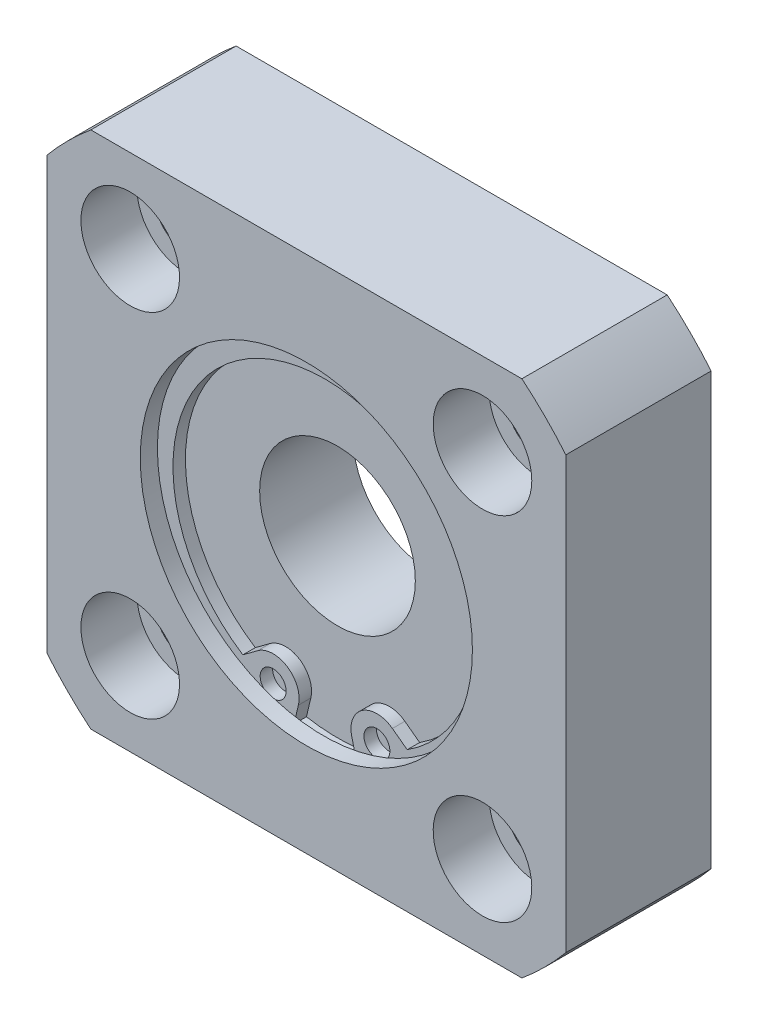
ISO-10303-21;
HEADER;
FILE_DESCRIPTION(('STEP AP214'),'2;1');
FILE_NAME('part.step','',(''),(''),'','','');
FILE_SCHEMA(('AUTOMOTIVE_DESIGN { 1 0 10303 214 1 1 1 1 }'));
ENDSEC;
DATA;
#1=APPLICATION_CONTEXT('core data for automotive mechanical design processes');
#2=APPLICATION_PROTOCOL_DEFINITION('international standard','automotive_design',2000,#1);
#3=PRODUCT_CONTEXT('',#1,'mechanical');
#4=PRODUCT('Part','Part','',(#3));
#5=PRODUCT_RELATED_PRODUCT_CATEGORY('part','',(#4));
#6=PRODUCT_DEFINITION_FORMATION('','',#4);
#7=PRODUCT_DEFINITION_CONTEXT('part definition',#1,'design');
#8=PRODUCT_DEFINITION('design','',#6,#7);
#9=PRODUCT_DEFINITION_SHAPE('','',#8);
#10=(LENGTH_UNIT() NAMED_UNIT(*) SI_UNIT(.MILLI.,.METRE.));
#11=(NAMED_UNIT(*) PLANE_ANGLE_UNIT() SI_UNIT($,.RADIAN.));
#12=(NAMED_UNIT(*) SI_UNIT($,.STERADIAN.) SOLID_ANGLE_UNIT());
#13=UNCERTAINTY_MEASURE_WITH_UNIT(LENGTH_MEASURE(1.E-05),#10,'distance_accuracy_value','');
#14=(GEOMETRIC_REPRESENTATION_CONTEXT(3) GLOBAL_UNCERTAINTY_ASSIGNED_CONTEXT((#13)) GLOBAL_UNIT_ASSIGNED_CONTEXT((#10,
#11,#12)) REPRESENTATION_CONTEXT('',''));
#15=CARTESIAN_POINT('',(0.,0.,0.));
#16=DIRECTION('',(0.,0.,1.));
#17=DIRECTION('',(1.,0.,0.));
#18=AXIS2_PLACEMENT_3D('',#15,#16,#17);
#19=CARTESIAN_POINT('',(0.,0.,11.));
#20=DIRECTION('',(0.,0.,1.));
#21=DIRECTION('',(1.,0.,0.));
#22=AXIS2_PLACEMENT_3D('',#19,#20,#21);
#23=PLANE('',#22);
#24=CARTESIAN_POINT('',(5.,-14.2233767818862,11.));
#25=DIRECTION('',(0.,0.,1.));
#26=DIRECTION('',(1.,0.,0.));
#27=AXIS2_PLACEMENT_3D('',#24,#25,#26);
#28=CIRCLE('',#27,1.25);
#29=CARTESIAN_POINT('',(6.25,-14.2233767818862,11.));
#30=VERTEX_POINT('',#29);
#31=EDGE_CURVE('E169',#30,#30,#28,.T.);
#32=ORIENTED_EDGE('',*,*,#31,.T.);
#33=EDGE_LOOP('',(#32));
#34=FACE_BOUND('',#33,.T.);
#35=ADVANCED_FACE('F14',(#34),#23,.T.);
#36=CARTESIAN_POINT('',(-5.,-14.2233767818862,11.));
#37=DIRECTION('',(0.,0.,-1.));
#38=DIRECTION('',(1.,0.,0.));
#39=AXIS2_PLACEMENT_3D('',#36,#37,#38);
#40=CIRCLE('',#39,1.25);
#41=CARTESIAN_POINT('',(-3.75,-14.2233767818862,11.));
#42=VERTEX_POINT('',#41);
#43=EDGE_CURVE('E179',#42,#42,#40,.T.);
#44=ORIENTED_EDGE('',*,*,#43,.F.);
#45=EDGE_LOOP('',(#44));
#46=FACE_BOUND('',#45,.T.);
#47=ADVANCED_FACE('F377',(#46),#23,.T.);
#48=CARTESIAN_POINT('',(16.9705627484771,16.9705627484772,8.6));
#49=DIRECTION('',(0.,0.,1.));
#50=DIRECTION('',(1.,0.,0.));
#51=AXIS2_PLACEMENT_3D('',#48,#49,#50);
#52=PLANE('',#51);
#53=CARTESIAN_POINT('',(16.9705627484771,16.9705627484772,8.6));
#54=DIRECTION('',(0.,0.,1.));
#55=DIRECTION('',(1.,0.,0.));
#56=AXIS2_PLACEMENT_3D('',#53,#54,#55);
#57=CIRCLE('',#56,4.75);
#58=CARTESIAN_POINT('',(21.7205627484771,16.9705627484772,8.6));
#59=VERTEX_POINT('',#58);
#60=EDGE_CURVE('E274',#59,#59,#57,.T.);
#61=ORIENTED_EDGE('',*,*,#60,.T.);
#62=EDGE_LOOP('',(#61));
#63=FACE_BOUND('',#62,.T.);
#64=CARTESIAN_POINT('',(16.9705627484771,16.9705627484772,8.6));
#65=DIRECTION('',(0.,0.,1.));
#66=DIRECTION('',(1.,0.,0.));
#67=AXIS2_PLACEMENT_3D('',#64,#65,#66);
#68=CIRCLE('',#67,3.);
#69=CARTESIAN_POINT('',(19.970562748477,16.9705627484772,8.6));
#70=VERTEX_POINT('',#69);
#71=EDGE_CURVE('E277',#70,#70,#68,.F.);
#72=ORIENTED_EDGE('',*,*,#71,.T.);
#73=EDGE_LOOP('',(#72));
#74=FACE_BOUND('',#73,.T.);
#75=ADVANCED_FACE('F385',(#63,#74),#52,.T.);
#76=CARTESIAN_POINT('',(16.9705627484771,-16.9705627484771,8.6));
#77=DIRECTION('',(0.,0.,1.));
#78=DIRECTION('',(0.,-1.,0.));
#79=AXIS2_PLACEMENT_3D('',#76,#77,#78);
#80=PLANE('',#79);
#81=CARTESIAN_POINT('',(16.9705627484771,-16.9705627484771,8.6));
#82=DIRECTION('',(0.,0.,1.));
#83=DIRECTION('',(0.,-1.,0.));
#84=AXIS2_PLACEMENT_3D('',#81,#82,#83);
#85=CIRCLE('',#84,4.75);
#86=CARTESIAN_POINT('',(16.9705627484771,-21.7205627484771,8.6));
#87=VERTEX_POINT('',#86);
#88=EDGE_CURVE('E258',#87,#87,#85,.T.);
#89=ORIENTED_EDGE('',*,*,#88,.T.);
#90=EDGE_LOOP('',(#89));
#91=FACE_BOUND('',#90,.T.);
#92=CARTESIAN_POINT('',(16.9705627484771,-16.9705627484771,8.6));
#93=DIRECTION('',(0.,0.,1.));
#94=DIRECTION('',(1.,0.,0.));
#95=AXIS2_PLACEMENT_3D('',#92,#93,#94);
#96=CIRCLE('',#95,3.);
#97=CARTESIAN_POINT('',(19.9705627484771,-16.9705627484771,8.6));
#98=VERTEX_POINT('',#97);
#99=EDGE_CURVE('E261',#98,#98,#96,.F.);
#100=ORIENTED_EDGE('',*,*,#99,.T.);
#101=EDGE_LOOP('',(#100));
#102=FACE_BOUND('',#101,.T.);
#103=ADVANCED_FACE('F754',(#91,#102),#80,.T.);
#104=CARTESIAN_POINT('',(-16.9705627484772,-16.9705627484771,8.6));
#105=DIRECTION('',(0.,0.,1.));
#106=DIRECTION('',(-1.,0.,0.));
#107=AXIS2_PLACEMENT_3D('',#104,#105,#106);
#108=PLANE('',#107);
#109=CARTESIAN_POINT('',(-16.9705627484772,-16.9705627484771,8.6));
#110=DIRECTION('',(0.,0.,1.));
#111=DIRECTION('',(-1.,0.,0.));
#112=AXIS2_PLACEMENT_3D('',#109,#110,#111);
#113=CIRCLE('',#112,4.75);
#114=CARTESIAN_POINT('',(-21.7205627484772,-16.9705627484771,8.6));
#115=VERTEX_POINT('',#114);
#116=EDGE_CURVE('E251',#115,#115,#113,.T.);
#117=ORIENTED_EDGE('',*,*,#116,.T.);
#118=EDGE_LOOP('',(#117));
#119=FACE_BOUND('',#118,.T.);
#120=CARTESIAN_POINT('',(-16.9705627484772,-16.9705627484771,8.6));
#121=DIRECTION('',(0.,0.,1.));
#122=DIRECTION('',(1.,0.,0.));
#123=AXIS2_PLACEMENT_3D('',#120,#121,#122);
#124=CIRCLE('',#123,3.);
#125=CARTESIAN_POINT('',(-13.9705627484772,-16.9705627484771,8.6));
#126=VERTEX_POINT('',#125);
#127=EDGE_CURVE('E254',#126,#126,#124,.F.);
#128=ORIENTED_EDGE('',*,*,#127,.T.);
#129=EDGE_LOOP('',(#128));
#130=FACE_BOUND('',#129,.T.);
#131=ADVANCED_FACE('F744',(#119,#130),#108,.T.);
#132=CARTESIAN_POINT('',(-16.9705627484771,16.9705627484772,8.6));
#133=DIRECTION('',(0.,0.,1.));
#134=DIRECTION('',(0.,1.,0.));
#135=AXIS2_PLACEMENT_3D('',#132,#133,#134);
#136=PLANE('',#135);
#137=CARTESIAN_POINT('',(-16.9705627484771,16.9705627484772,8.6));
#138=DIRECTION('',(0.,0.,1.));
#139=DIRECTION('',(0.,1.,0.));
#140=AXIS2_PLACEMENT_3D('',#137,#138,#139);
#141=CIRCLE('',#140,4.75);
#142=CARTESIAN_POINT('',(-16.970562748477,21.7205627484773,8.6));
#143=VERTEX_POINT('',#142);
#144=EDGE_CURVE('E244',#143,#143,#141,.T.);
#145=ORIENTED_EDGE('',*,*,#144,.T.);
#146=EDGE_LOOP('',(#145));
#147=FACE_BOUND('',#146,.T.);
#148=CARTESIAN_POINT('',(-16.9705627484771,16.9705627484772,8.6));
#149=DIRECTION('',(0.,0.,1.));
#150=DIRECTION('',(1.,0.,0.));
#151=AXIS2_PLACEMENT_3D('',#148,#149,#150);
#152=CIRCLE('',#151,3.);
#153=CARTESIAN_POINT('',(-13.9705627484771,16.9705627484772,8.6));
#154=VERTEX_POINT('',#153);
#155=EDGE_CURVE('E247',#154,#154,#152,.F.);
#156=ORIENTED_EDGE('',*,*,#155,.T.);
#157=EDGE_LOOP('',(#156));
#158=FACE_BOUND('',#157,.T.);
#159=ADVANCED_FACE('F734',(#147,#158),#136,.T.);
#160=CARTESIAN_POINT('',(16.9705627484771,16.9705627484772,0.));
#161=DIRECTION('',(0.,0.,1.));
#162=DIRECTION('',(1.,0.,0.));
#163=AXIS2_PLACEMENT_3D('',#160,#161,#162);
#164=CYLINDRICAL_SURFACE('',#163,3.);
#165=CARTESIAN_POINT('',(16.9705627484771,16.9705627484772,0.));
#166=DIRECTION('',(0.,0.,1.));
#167=DIRECTION('',(1.,0.,0.));
#168=AXIS2_PLACEMENT_3D('',#165,#166,#167);
#169=CIRCLE('',#168,3.);
#170=CARTESIAN_POINT('',(19.970562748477,16.9705627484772,0.));
#171=VERTEX_POINT('',#170);
#172=EDGE_CURVE('E278',#171,#171,#169,.T.);
#173=ORIENTED_EDGE('',*,*,#172,.F.);
#174=EDGE_LOOP('',(#173));
#175=FACE_BOUND('',#174,.T.);
#176=ORIENTED_EDGE('',*,*,#71,.F.);
#177=EDGE_LOOP('',(#176));
#178=FACE_BOUND('',#177,.T.);
#179=ADVANCED_FACE('F724',(#175,#178),#164,.F.);
#180=CARTESIAN_POINT('',(16.9705627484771,-16.9705627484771,0.));
#181=DIRECTION('',(0.,0.,1.));
#182=DIRECTION('',(1.,0.,0.));
#183=AXIS2_PLACEMENT_3D('',#180,#181,#182);
#184=CYLINDRICAL_SURFACE('',#183,3.);
#185=CARTESIAN_POINT('',(16.9705627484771,-16.9705627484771,0.));
#186=DIRECTION('',(0.,0.,1.));
#187=DIRECTION('',(0.,-1.,0.));
#188=AXIS2_PLACEMENT_3D('',#185,#186,#187);
#189=CIRCLE('',#188,3.);
#190=CARTESIAN_POINT('',(16.9705627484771,-19.9705627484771,0.));
#191=VERTEX_POINT('',#190);
#192=EDGE_CURVE('E268',#191,#191,#189,.T.);
#193=ORIENTED_EDGE('',*,*,#192,.F.);
#194=EDGE_LOOP('',(#193));
#195=FACE_BOUND('',#194,.T.);
#196=ORIENTED_EDGE('',*,*,#99,.F.);
#197=EDGE_LOOP('',(#196));
#198=FACE_BOUND('',#197,.T.);
#199=ADVANCED_FACE('F714',(#195,#198),#184,.F.);
#200=CARTESIAN_POINT('',(-16.9705627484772,-16.9705627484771,0.));
#201=DIRECTION('',(0.,0.,1.));
#202=DIRECTION('',(1.,0.,0.));
#203=AXIS2_PLACEMENT_3D('',#200,#201,#202);
#204=CYLINDRICAL_SURFACE('',#203,3.);
#205=CARTESIAN_POINT('',(-16.9705627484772,-16.9705627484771,0.));
#206=DIRECTION('',(0.,0.,1.));
#207=DIRECTION('',(-1.,0.,0.));
#208=AXIS2_PLACEMENT_3D('',#205,#206,#207);
#209=CIRCLE('',#208,3.);
#210=CARTESIAN_POINT('',(-19.9705627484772,-16.9705627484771,0.));
#211=VERTEX_POINT('',#210);
#212=EDGE_CURVE('E265',#211,#211,#209,.T.);
#213=ORIENTED_EDGE('',*,*,#212,.F.);
#214=EDGE_LOOP('',(#213));
#215=FACE_BOUND('',#214,.T.);
#216=ORIENTED_EDGE('',*,*,#127,.F.);
#217=EDGE_LOOP('',(#216));
#218=FACE_BOUND('',#217,.T.);
#219=ADVANCED_FACE('F704',(#215,#218),#204,.F.);
#220=CARTESIAN_POINT('',(-16.9705627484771,16.9705627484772,0.));
#221=DIRECTION('',(0.,0.,1.));
#222=DIRECTION('',(1.,0.,0.));
#223=AXIS2_PLACEMENT_3D('',#220,#221,#222);
#224=CYLINDRICAL_SURFACE('',#223,3.);
#225=CARTESIAN_POINT('',(-16.9705627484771,16.9705627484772,0.));
#226=DIRECTION('',(0.,0.,1.));
#227=DIRECTION('',(0.,1.,0.));
#228=AXIS2_PLACEMENT_3D('',#225,#226,#227);
#229=CIRCLE('',#228,3.);
#230=CARTESIAN_POINT('',(-16.970562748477,19.9705627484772,0.));
#231=VERTEX_POINT('',#230);
#232=EDGE_CURVE('E262',#231,#231,#229,.T.);
#233=ORIENTED_EDGE('',*,*,#232,.F.);
#234=EDGE_LOOP('',(#233));
#235=FACE_BOUND('',#234,.T.);
#236=ORIENTED_EDGE('',*,*,#155,.F.);
#237=EDGE_LOOP('',(#236));
#238=FACE_BOUND('',#237,.T.);
#239=ADVANCED_FACE('F694',(#235,#238),#224,.F.);
#240=CARTESIAN_POINT('',(-20.7665596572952,-25.,14.));
#241=DIRECTION('',(0.,1.,0.));
#242=DIRECTION('',(0.,0.,1.));
#243=AXIS2_PLACEMENT_3D('',#240,#241,#242);
#244=PLANE('',#243);
#245=DIRECTION('',(1.,0.,0.));
#246=VECTOR('',#245,1.);
#247=CARTESIAN_POINT('',(-20.7665596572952,-25.,14.));
#248=LINE('',#247,#246);
#249=CARTESIAN_POINT('',(-20.7665596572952,-25.,14.));
#250=VERTEX_POINT('',#249);
#251=CARTESIAN_POINT('',(20.7665596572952,-25.,14.));
#252=VERTEX_POINT('',#251);
#253=EDGE_CURVE('E306',#250,#252,#248,.T.);
#254=ORIENTED_EDGE('',*,*,#253,.F.);
#255=DIRECTION('',(0.,0.,-1.));
#256=VECTOR('',#255,1.);
#257=CARTESIAN_POINT('',(-20.7665596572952,-25.,14.));
#258=LINE('',#257,#256);
#259=CARTESIAN_POINT('',(-20.7665596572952,-25.,0.));
#260=VERTEX_POINT('',#259);
#261=EDGE_CURVE('E329',#250,#260,#258,.T.);
#262=ORIENTED_EDGE('',*,*,#261,.T.);
#263=DIRECTION('',(1.,0.,0.));
#264=VECTOR('',#263,1.);
#265=CARTESIAN_POINT('',(-20.7665596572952,-25.,0.));
#266=LINE('',#265,#264);
#267=CARTESIAN_POINT('',(20.7665596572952,-25.,0.));
#268=VERTEX_POINT('',#267);
#269=EDGE_CURVE('E284',#260,#268,#266,.T.);
#270=ORIENTED_EDGE('',*,*,#269,.T.);
#271=DIRECTION('',(0.,0.,-1.));
#272=VECTOR('',#271,1.);
#273=CARTESIAN_POINT('',(20.7665596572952,-25.,14.));
#274=LINE('',#273,#272);
#275=EDGE_CURVE('E327',#252,#268,#274,.T.);
#276=ORIENTED_EDGE('',*,*,#275,.F.);
#277=EDGE_LOOP('',(#254,#262,#270,#276));
#278=FACE_BOUND('',#277,.T.);
#279=ADVANCED_FACE('F684',(#278),#244,.F.);
#280=CARTESIAN_POINT('',(0.,0.,14.));
#281=DIRECTION('',(0.,0.,-1.));
#282=DIRECTION('',(-1.,0.,0.));
#283=AXIS2_PLACEMENT_3D('',#280,#281,#282);
#284=CYLINDRICAL_SURFACE('',#283,32.5);
#285=ORIENTED_EDGE('',*,*,#261,.F.);
#286=CARTESIAN_POINT('',(0.,0.,14.));
#287=DIRECTION('',(0.,0.,1.));
#288=DIRECTION('',(1.,0.,0.));
#289=AXIS2_PLACEMENT_3D('',#286,#287,#288);
#290=CIRCLE('',#289,32.5);
#291=CARTESIAN_POINT('',(-25.,-20.7665596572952,14.));
#292=VERTEX_POINT('',#291);
#293=EDGE_CURVE('E309',#292,#250,#290,.T.);
#294=ORIENTED_EDGE('',*,*,#293,.F.);
#295=DIRECTION('',(0.,0.,-1.));
#296=VECTOR('',#295,1.);
#297=CARTESIAN_POINT('',(-25.,-20.7665596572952,14.));
#298=LINE('',#297,#296);
#299=CARTESIAN_POINT('',(-25.,-20.7665596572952,0.));
#300=VERTEX_POINT('',#299);
#301=EDGE_CURVE('E331',#292,#300,#298,.T.);
#302=ORIENTED_EDGE('',*,*,#301,.T.);
#303=CARTESIAN_POINT('',(0.,0.,0.));
#304=DIRECTION('',(0.,0.,1.));
#305=DIRECTION('',(1.,0.,0.));
#306=AXIS2_PLACEMENT_3D('',#303,#304,#305);
#307=CIRCLE('',#306,32.5);
#308=EDGE_CURVE('E287',#300,#260,#307,.T.);
#309=ORIENTED_EDGE('',*,*,#308,.T.);
#310=EDGE_LOOP('',(#285,#294,#302,#309));
#311=FACE_BOUND('',#310,.T.);
#312=ADVANCED_FACE('F674',(#311),#284,.T.);
#313=CARTESIAN_POINT('',(-25.,-20.7665596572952,14.));
#314=DIRECTION('',(-1.,0.,0.));
#315=DIRECTION('',(0.,0.,1.));
#316=AXIS2_PLACEMENT_3D('',#313,#314,#315);
#317=PLANE('',#316);
#318=ORIENTED_EDGE('',*,*,#301,.F.);
#319=DIRECTION('',(0.,1.,0.));
#320=VECTOR('',#319,1.);
#321=CARTESIAN_POINT('',(-25.,-20.7665596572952,14.));
#322=LINE('',#321,#320);
#323=CARTESIAN_POINT('',(-25.,20.7665596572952,14.));
#324=VERTEX_POINT('',#323);
#325=EDGE_CURVE('E312',#292,#324,#322,.T.);
#326=ORIENTED_EDGE('',*,*,#325,.T.);
#327=DIRECTION('',(0.,0.,-1.));
#328=VECTOR('',#327,1.);
#329=CARTESIAN_POINT('',(-25.,20.7665596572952,14.));
#330=LINE('',#329,#328);
#331=CARTESIAN_POINT('',(-25.,20.7665596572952,0.));
#332=VERTEX_POINT('',#331);
#333=EDGE_CURVE('E333',#324,#332,#330,.T.);
#334=ORIENTED_EDGE('',*,*,#333,.T.);
#335=DIRECTION('',(0.,1.,0.));
#336=VECTOR('',#335,1.);
#337=CARTESIAN_POINT('',(-25.,-20.7665596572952,0.));
#338=LINE('',#337,#336);
#339=EDGE_CURVE('E290',#300,#332,#338,.T.);
#340=ORIENTED_EDGE('',*,*,#339,.F.);
#341=EDGE_LOOP('',(#318,#326,#334,#340));
#342=FACE_BOUND('',#341,.T.);
#343=ADVANCED_FACE('F664',(#342),#317,.T.);
#344=CARTESIAN_POINT('',(0.,0.,14.));
#345=DIRECTION('',(0.,0.,-1.));
#346=DIRECTION('',(-1.,0.,0.));
#347=AXIS2_PLACEMENT_3D('',#344,#345,#346);
#348=CYLINDRICAL_SURFACE('',#347,32.5);
#349=ORIENTED_EDGE('',*,*,#333,.F.);
#350=CARTESIAN_POINT('',(0.,0.,14.));
#351=DIRECTION('',(0.,0.,-1.));
#352=DIRECTION('',(-1.,0.,0.));
#353=AXIS2_PLACEMENT_3D('',#350,#351,#352);
#354=CIRCLE('',#353,32.5);
#355=CARTESIAN_POINT('',(-20.7665596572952,25.,14.));
#356=VERTEX_POINT('',#355);
#357=EDGE_CURVE('E315',#324,#356,#354,.T.);
#358=ORIENTED_EDGE('',*,*,#357,.T.);
#359=DIRECTION('',(0.,0.,-1.));
#360=VECTOR('',#359,1.);
#361=CARTESIAN_POINT('',(-20.7665596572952,25.,14.));
#362=LINE('',#361,#360);
#363=CARTESIAN_POINT('',(-20.7665596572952,25.,0.));
#364=VERTEX_POINT('',#363);
#365=EDGE_CURVE('E335',#356,#364,#362,.T.);
#366=ORIENTED_EDGE('',*,*,#365,.T.);
#367=CARTESIAN_POINT('',(0.,0.,0.));
#368=DIRECTION('',(0.,0.,-1.));
#369=DIRECTION('',(-1.,0.,0.));
#370=AXIS2_PLACEMENT_3D('',#367,#368,#369);
#371=CIRCLE('',#370,32.5);
#372=EDGE_CURVE('E293',#332,#364,#371,.T.);
#373=ORIENTED_EDGE('',*,*,#372,.F.);
#374=EDGE_LOOP('',(#349,#358,#366,#373));
#375=FACE_BOUND('',#374,.T.);
#376=ADVANCED_FACE('F654',(#375),#348,.T.);
#377=CARTESIAN_POINT('',(-20.7665596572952,25.,14.));
#378=DIRECTION('',(0.,1.,0.));
#379=DIRECTION('',(0.,0.,1.));
#380=AXIS2_PLACEMENT_3D('',#377,#378,#379);
#381=PLANE('',#380);
#382=ORIENTED_EDGE('',*,*,#365,.F.);
#383=DIRECTION('',(1.,0.,0.));
#384=VECTOR('',#383,1.);
#385=CARTESIAN_POINT('',(-20.7665596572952,25.,14.));
#386=LINE('',#385,#384);
#387=CARTESIAN_POINT('',(20.7665596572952,25.,14.));
#388=VERTEX_POINT('',#387);
#389=EDGE_CURVE('E318',#356,#388,#386,.T.);
#390=ORIENTED_EDGE('',*,*,#389,.T.);
#391=DIRECTION('',(0.,0.,-1.));
#392=VECTOR('',#391,1.);
#393=CARTESIAN_POINT('',(20.7665596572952,25.,14.));
#394=LINE('',#393,#392);
#395=CARTESIAN_POINT('',(20.7665596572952,25.,0.));
#396=VERTEX_POINT('',#395);
#397=EDGE_CURVE('E337',#388,#396,#394,.T.);
#398=ORIENTED_EDGE('',*,*,#397,.T.);
#399=DIRECTION('',(1.,0.,0.));
#400=VECTOR('',#399,1.);
#401=CARTESIAN_POINT('',(-20.7665596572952,25.,0.));
#402=LINE('',#401,#400);
#403=EDGE_CURVE('E296',#364,#396,#402,.T.);
#404=ORIENTED_EDGE('',*,*,#403,.F.);
#405=EDGE_LOOP('',(#382,#390,#398,#404));
#406=FACE_BOUND('',#405,.T.);
#407=ADVANCED_FACE('F645',(#406),#381,.T.);
#408=CARTESIAN_POINT('',(0.,0.,14.));
#409=DIRECTION('',(0.,0.,-1.));
#410=DIRECTION('',(-1.,0.,0.));
#411=AXIS2_PLACEMENT_3D('',#408,#409,#410);
#412=CYLINDRICAL_SURFACE('',#411,32.5);
#413=ORIENTED_EDGE('',*,*,#397,.F.);
#414=CARTESIAN_POINT('',(0.,0.,14.));
#415=DIRECTION('',(0.,0.,1.));
#416=DIRECTION('',(1.,0.,0.));
#417=AXIS2_PLACEMENT_3D('',#414,#415,#416);
#418=CIRCLE('',#417,32.5);
#419=CARTESIAN_POINT('',(25.,20.7665596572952,14.));
#420=VERTEX_POINT('',#419);
#421=EDGE_CURVE('E321',#420,#388,#418,.T.);
#422=ORIENTED_EDGE('',*,*,#421,.F.);
#423=DIRECTION('',(0.,0.,-1.));
#424=VECTOR('',#423,1.);
#425=CARTESIAN_POINT('',(25.,20.7665596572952,14.));
#426=LINE('',#425,#424);
#427=CARTESIAN_POINT('',(25.,20.7665596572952,0.));
#428=VERTEX_POINT('',#427);
#429=EDGE_CURVE('E82',#420,#428,#426,.T.);
#430=ORIENTED_EDGE('',*,*,#429,.T.);
#431=CARTESIAN_POINT('',(0.,0.,0.));
#432=DIRECTION('',(0.,0.,1.));
#433=DIRECTION('',(1.,0.,0.));
#434=AXIS2_PLACEMENT_3D('',#431,#432,#433);
#435=CIRCLE('',#434,32.5);
#436=EDGE_CURVE('E299',#428,#396,#435,.T.);
#437=ORIENTED_EDGE('',*,*,#436,.T.);
#438=EDGE_LOOP('',(#413,#422,#430,#437));
#439=FACE_BOUND('',#438,.T.);
#440=ADVANCED_FACE('F637',(#439),#412,.T.);
#441=CARTESIAN_POINT('',(25.,-20.7665596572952,14.));
#442=DIRECTION('',(-1.,0.,0.));
#443=DIRECTION('',(0.,0.,1.));
#444=AXIS2_PLACEMENT_3D('',#441,#442,#443);
#445=PLANE('',#444);
#446=ORIENTED_EDGE('',*,*,#429,.F.);
#447=DIRECTION('',(0.,1.,0.));
#448=VECTOR('',#447,1.);
#449=CARTESIAN_POINT('',(25.,-20.7665596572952,14.));
#450=LINE('',#449,#448);
#451=CARTESIAN_POINT('',(25.,-20.7665596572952,14.));
#452=VERTEX_POINT('',#451);
#453=EDGE_CURVE('E324',#452,#420,#450,.T.);
#454=ORIENTED_EDGE('',*,*,#453,.F.);
#455=DIRECTION('',(0.,0.,-1.));
#456=VECTOR('',#455,1.);
#457=CARTESIAN_POINT('',(25.,-20.7665596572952,14.));
#458=LINE('',#457,#456);
#459=CARTESIAN_POINT('',(25.,-20.7665596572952,0.));
#460=VERTEX_POINT('',#459);
#461=EDGE_CURVE('E89',#452,#460,#458,.T.);
#462=ORIENTED_EDGE('',*,*,#461,.T.);
#463=DIRECTION('',(0.,1.,0.));
#464=VECTOR('',#463,1.);
#465=CARTESIAN_POINT('',(25.,-20.7665596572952,0.));
#466=LINE('',#465,#464);
#467=EDGE_CURVE('E302',#460,#428,#466,.T.);
#468=ORIENTED_EDGE('',*,*,#467,.T.);
#469=EDGE_LOOP('',(#446,#454,#462,#468));
#470=FACE_BOUND('',#469,.T.);
#471=ADVANCED_FACE('F16',(#470),#445,.F.);
#472=CARTESIAN_POINT('',(0.,0.,14.));
#473=DIRECTION('',(0.,0.,-1.));
#474=DIRECTION('',(-1.,0.,0.));
#475=AXIS2_PLACEMENT_3D('',#472,#473,#474);
#476=CYLINDRICAL_SURFACE('',#475,32.5);
#477=ORIENTED_EDGE('',*,*,#461,.F.);
#478=CARTESIAN_POINT('',(0.,0.,14.));
#479=DIRECTION('',(0.,0.,-1.));
#480=DIRECTION('',(-1.,0.,0.));
#481=AXIS2_PLACEMENT_3D('',#478,#479,#480);
#482=CIRCLE('',#481,32.5);
#483=EDGE_CURVE('E304',#452,#252,#482,.T.);
#484=ORIENTED_EDGE('',*,*,#483,.T.);
#485=ORIENTED_EDGE('',*,*,#275,.T.);
#486=CARTESIAN_POINT('',(0.,0.,0.));
#487=DIRECTION('',(0.,0.,-1.));
#488=DIRECTION('',(-1.,0.,0.));
#489=AXIS2_PLACEMENT_3D('',#486,#487,#488);
#490=CIRCLE('',#489,32.5);
#491=EDGE_CURVE('E281',#460,#268,#490,.T.);
#492=ORIENTED_EDGE('',*,*,#491,.F.);
#493=EDGE_LOOP('',(#477,#484,#485,#492));
#494=FACE_BOUND('',#493,.T.);
#495=ADVANCED_FACE('F619',(#494),#476,.T.);
#496=CARTESIAN_POINT('',(16.9705627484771,16.9705627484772,8.6));
#497=DIRECTION('',(0.,0.,1.));
#498=DIRECTION('',(1.,0.,0.));
#499=AXIS2_PLACEMENT_3D('',#496,#497,#498);
#500=CYLINDRICAL_SURFACE('',#499,4.75);
#501=ORIENTED_EDGE('',*,*,#60,.F.);
#502=EDGE_LOOP('',(#501));
#503=FACE_BOUND('',#502,.T.);
#504=CARTESIAN_POINT('',(16.9705627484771,16.9705627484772,14.));
#505=DIRECTION('',(0.,0.,1.));
#506=DIRECTION('',(1.,0.,0.));
#507=AXIS2_PLACEMENT_3D('',#504,#505,#506);
#508=CIRCLE('',#507,4.75);
#509=CARTESIAN_POINT('',(21.7205627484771,16.9705627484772,14.));
#510=VERTEX_POINT('',#509);
#511=EDGE_CURVE('E271',#510,#510,#508,.T.);
#512=ORIENTED_EDGE('',*,*,#511,.T.);
#513=EDGE_LOOP('',(#512));
#514=FACE_BOUND('',#513,.T.);
#515=ADVANCED_FACE('F609',(#503,#514),#500,.F.);
#516=CARTESIAN_POINT('',(16.9705627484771,-16.9705627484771,8.6));
#517=DIRECTION('',(0.,0.,1.));
#518=DIRECTION('',(1.,0.,0.));
#519=AXIS2_PLACEMENT_3D('',#516,#517,#518);
#520=CYLINDRICAL_SURFACE('',#519,4.75);
#521=ORIENTED_EDGE('',*,*,#88,.F.);
#522=EDGE_LOOP('',(#521));
#523=FACE_BOUND('',#522,.T.);
#524=CARTESIAN_POINT('',(16.9705627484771,-16.9705627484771,14.));
#525=DIRECTION('',(0.,0.,1.));
#526=DIRECTION('',(0.,-1.,0.));
#527=AXIS2_PLACEMENT_3D('',#524,#525,#526);
#528=CIRCLE('',#527,4.75);
#529=CARTESIAN_POINT('',(16.9705627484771,-21.7205627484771,14.));
#530=VERTEX_POINT('',#529);
#531=EDGE_CURVE('E255',#530,#530,#528,.T.);
#532=ORIENTED_EDGE('',*,*,#531,.T.);
#533=EDGE_LOOP('',(#532));
#534=FACE_BOUND('',#533,.T.);
#535=ADVANCED_FACE('F599',(#523,#534),#520,.F.);
#536=CARTESIAN_POINT('',(-16.9705627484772,-16.9705627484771,8.6));
#537=DIRECTION('',(0.,0.,1.));
#538=DIRECTION('',(1.,0.,0.));
#539=AXIS2_PLACEMENT_3D('',#536,#537,#538);
#540=CYLINDRICAL_SURFACE('',#539,4.75);
#541=ORIENTED_EDGE('',*,*,#116,.F.);
#542=EDGE_LOOP('',(#541));
#543=FACE_BOUND('',#542,.T.);
#544=CARTESIAN_POINT('',(-16.9705627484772,-16.9705627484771,14.));
#545=DIRECTION('',(0.,0.,1.));
#546=DIRECTION('',(-1.,0.,0.));
#547=AXIS2_PLACEMENT_3D('',#544,#545,#546);
#548=CIRCLE('',#547,4.75);
#549=CARTESIAN_POINT('',(-21.7205627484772,-16.9705627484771,14.));
#550=VERTEX_POINT('',#549);
#551=EDGE_CURVE('E248',#550,#550,#548,.T.);
#552=ORIENTED_EDGE('',*,*,#551,.T.);
#553=EDGE_LOOP('',(#552));
#554=FACE_BOUND('',#553,.T.);
#555=ADVANCED_FACE('F589',(#543,#554),#540,.F.);
#556=CARTESIAN_POINT('',(-16.9705627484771,16.9705627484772,8.6));
#557=DIRECTION('',(0.,0.,1.));
#558=DIRECTION('',(1.,0.,0.));
#559=AXIS2_PLACEMENT_3D('',#556,#557,#558);
#560=CYLINDRICAL_SURFACE('',#559,4.75);
#561=ORIENTED_EDGE('',*,*,#144,.F.);
#562=EDGE_LOOP('',(#561));
#563=FACE_BOUND('',#562,.T.);
#564=CARTESIAN_POINT('',(-16.9705627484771,16.9705627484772,14.));
#565=DIRECTION('',(0.,0.,1.));
#566=DIRECTION('',(0.,1.,0.));
#567=AXIS2_PLACEMENT_3D('',#564,#565,#566);
#568=CIRCLE('',#567,4.75);
#569=CARTESIAN_POINT('',(-16.970562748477,21.7205627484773,14.));
#570=VERTEX_POINT('',#569);
#571=EDGE_CURVE('E241',#570,#570,#568,.T.);
#572=ORIENTED_EDGE('',*,*,#571,.T.);
#573=EDGE_LOOP('',(#572));
#574=FACE_BOUND('',#573,.T.);
#575=ADVANCED_FACE('F579',(#563,#574),#560,.F.);
#576=CARTESIAN_POINT('',(0.,0.,0.));
#577=DIRECTION('',(0.,0.,-1.));
#578=DIRECTION('',(-1.,0.,0.));
#579=AXIS2_PLACEMENT_3D('',#576,#577,#578);
#580=PLANE('',#579);
#581=CARTESIAN_POINT('',(0.,0.,0.));
#582=DIRECTION('',(0.,0.,-1.));
#583=DIRECTION('',(-1.,0.,0.));
#584=AXIS2_PLACEMENT_3D('',#581,#582,#583);
#585=CIRCLE('',#584,14.);
#586=CARTESIAN_POINT('',(-14.,0.,0.));
#587=VERTEX_POINT('',#586);
#588=EDGE_CURVE('E230',#587,#587,#585,.T.);
#589=ORIENTED_EDGE('',*,*,#588,.F.);
#590=EDGE_LOOP('',(#589));
#591=FACE_BOUND('',#590,.T.);
#592=ORIENTED_EDGE('',*,*,#232,.T.);
#593=EDGE_LOOP('',(#592));
#594=FACE_BOUND('',#593,.T.);
#595=ORIENTED_EDGE('',*,*,#212,.T.);
#596=EDGE_LOOP('',(#595));
#597=FACE_BOUND('',#596,.T.);
#598=ORIENTED_EDGE('',*,*,#192,.T.);
#599=EDGE_LOOP('',(#598));
#600=FACE_BOUND('',#599,.T.);
#601=ORIENTED_EDGE('',*,*,#172,.T.);
#602=EDGE_LOOP('',(#601));
#603=FACE_BOUND('',#602,.T.);
#604=ORIENTED_EDGE('',*,*,#491,.T.);
#605=ORIENTED_EDGE('',*,*,#269,.F.);
#606=ORIENTED_EDGE('',*,*,#308,.F.);
#607=ORIENTED_EDGE('',*,*,#339,.T.);
#608=ORIENTED_EDGE('',*,*,#372,.T.);
#609=ORIENTED_EDGE('',*,*,#403,.T.);
#610=ORIENTED_EDGE('',*,*,#436,.F.);
#611=ORIENTED_EDGE('',*,*,#467,.F.);
#612=EDGE_LOOP('',(#604,#605,#606,#607,#608,#609,#610,#611));
#613=FACE_BOUND('',#612,.T.);
#614=ADVANCED_FACE('F569',(#591,#594,#597,#600,#603,#613),#580,.T.);
#615=CARTESIAN_POINT('',(0.,0.,14.));
#616=DIRECTION('',(0.,0.,-1.));
#617=DIRECTION('',(-1.,0.,0.));
#618=AXIS2_PLACEMENT_3D('',#615,#616,#617);
#619=PLANE('',#618);
#620=CARTESIAN_POINT('',(0.,0.,14.));
#621=DIRECTION('',(0.,0.,1.));
#622=DIRECTION('',(1.,0.,0.));
#623=AXIS2_PLACEMENT_3D('',#620,#621,#622);
#624=CIRCLE('',#623,16.);
#625=CARTESIAN_POINT('',(16.,0.,14.));
#626=VERTEX_POINT('',#625);
#627=EDGE_CURVE('E237',#626,#626,#624,.T.);
#628=ORIENTED_EDGE('',*,*,#627,.F.);
#629=EDGE_LOOP('',(#628));
#630=FACE_BOUND('',#629,.T.);
#631=ORIENTED_EDGE('',*,*,#571,.F.);
#632=EDGE_LOOP('',(#631));
#633=FACE_BOUND('',#632,.T.);
#634=ORIENTED_EDGE('',*,*,#551,.F.);
#635=EDGE_LOOP('',(#634));
#636=FACE_BOUND('',#635,.T.);
#637=ORIENTED_EDGE('',*,*,#531,.F.);
#638=EDGE_LOOP('',(#637));
#639=FACE_BOUND('',#638,.T.);
#640=ORIENTED_EDGE('',*,*,#511,.F.);
#641=EDGE_LOOP('',(#640));
#642=FACE_BOUND('',#641,.T.);
#643=ORIENTED_EDGE('',*,*,#483,.F.);
#644=ORIENTED_EDGE('',*,*,#453,.T.);
#645=ORIENTED_EDGE('',*,*,#421,.T.);
#646=ORIENTED_EDGE('',*,*,#389,.F.);
#647=ORIENTED_EDGE('',*,*,#357,.F.);
#648=ORIENTED_EDGE('',*,*,#325,.F.);
#649=ORIENTED_EDGE('',*,*,#293,.T.);
#650=ORIENTED_EDGE('',*,*,#253,.T.);
#651=EDGE_LOOP('',(#643,#644,#645,#646,#647,#648,#649,#650));
#652=FACE_BOUND('',#651,.T.);
#653=ADVANCED_FACE('F560',(#630,#633,#636,#639,#642,#652),#619,.F.);
#654=CARTESIAN_POINT('',(0.,0.,2.));
#655=DIRECTION('',(0.,0.,-1.));
#656=DIRECTION('',(-1.,0.,0.));
#657=AXIS2_PLACEMENT_3D('',#654,#655,#656);
#658=CYLINDRICAL_SURFACE('',#657,14.);
#659=CARTESIAN_POINT('',(0.,0.,2.));
#660=DIRECTION('',(0.,0.,-1.));
#661=DIRECTION('',(-1.,0.,0.));
#662=AXIS2_PLACEMENT_3D('',#659,#660,#661);
#663=CIRCLE('',#662,14.);
#664=CARTESIAN_POINT('',(-14.,0.,2.));
#665=VERTEX_POINT('',#664);
#666=EDGE_CURVE('E233',#665,#665,#663,.T.);
#667=ORIENTED_EDGE('',*,*,#666,.F.);
#668=EDGE_LOOP('',(#667));
#669=FACE_BOUND('',#668,.T.);
#670=ORIENTED_EDGE('',*,*,#588,.T.);
#671=EDGE_LOOP('',(#670));
#672=FACE_BOUND('',#671,.T.);
#673=ADVANCED_FACE('F552',(#669,#672),#658,.F.);
#674=CARTESIAN_POINT('',(0.,0.,11.));
#675=DIRECTION('',(0.,0.,1.));
#676=DIRECTION('',(1.,0.,0.));
#677=AXIS2_PLACEMENT_3D('',#674,#675,#676);
#678=CYLINDRICAL_SURFACE('',#677,16.);
#679=CARTESIAN_POINT('',(0.,0.,12.35));
#680=DIRECTION('',(0.,0.,1.));
#681=DIRECTION('',(1.,0.,0.));
#682=AXIS2_PLACEMENT_3D('',#679,#680,#681);
#683=CIRCLE('',#682,16.);
#684=CARTESIAN_POINT('',(16.,0.,12.35));
#685=VERTEX_POINT('',#684);
#686=EDGE_CURVE('E228',#685,#685,#683,.F.);
#687=ORIENTED_EDGE('',*,*,#686,.T.);
#688=EDGE_LOOP('',(#687));
#689=FACE_BOUND('',#688,.T.);
#690=ORIENTED_EDGE('',*,*,#627,.T.);
#691=EDGE_LOOP('',(#690));
#692=FACE_BOUND('',#691,.T.);
#693=ADVANCED_FACE('F356',(#689,#692),#678,.F.);
#694=CARTESIAN_POINT('',(0.,0.,2.));
#695=DIRECTION('',(0.,0.,-1.));
#696=DIRECTION('',(-1.,0.,0.));
#697=AXIS2_PLACEMENT_3D('',#694,#695,#696);
#698=PLANE('',#697);
#699=CARTESIAN_POINT('',(0.,0.,2.));
#700=DIRECTION('',(0.,0.,-1.));
#701=DIRECTION('',(-1.,0.,0.));
#702=AXIS2_PLACEMENT_3D('',#699,#700,#701);
#703=CIRCLE('',#702,7.5);
#704=CARTESIAN_POINT('',(-7.5,0.,2.));
#705=VERTEX_POINT('',#704);
#706=EDGE_CURVE('E236',#705,#705,#703,.T.);
#707=ORIENTED_EDGE('',*,*,#706,.F.);
#708=EDGE_LOOP('',(#707));
#709=FACE_BOUND('',#708,.T.);
#710=ORIENTED_EDGE('',*,*,#666,.T.);
#711=EDGE_LOOP('',(#710));
#712=FACE_BOUND('',#711,.T.);
#713=ADVANCED_FACE('F361',(#709,#712),#698,.T.);
#714=CARTESIAN_POINT('',(0.,0.,12.35));
#715=DIRECTION('',(0.,0.,1.));
#716=DIRECTION('',(1.,0.,0.));
#717=AXIS2_PLACEMENT_3D('',#714,#715,#716);
#718=PLANE('',#717);
#719=CARTESIAN_POINT('',(0.,0.,12.35));
#720=DIRECTION('',(0.,0.,1.));
#721=DIRECTION('',(1.,0.,0.));
#722=AXIS2_PLACEMENT_3D('',#719,#720,#721);
#723=CIRCLE('',#722,16.85);
#724=CARTESIAN_POINT('',(16.85,0.,12.35));
#725=VERTEX_POINT('',#724);
#726=EDGE_CURVE('E225',#725,#725,#723,.T.);
#727=ORIENTED_EDGE('',*,*,#726,.F.);
#728=EDGE_LOOP('',(#727));
#729=FACE_BOUND('',#728,.T.);
#730=ORIENTED_EDGE('',*,*,#686,.F.);
#731=EDGE_LOOP('',(#730));
#732=FACE_BOUND('',#731,.T.);
#733=ADVANCED_FACE('F359',(#729,#732),#718,.F.);
#734=CARTESIAN_POINT('',(0.,0.,12.35));
#735=DIRECTION('',(0.,0.,-1.));
#736=DIRECTION('',(-1.,0.,0.));
#737=AXIS2_PLACEMENT_3D('',#734,#735,#736);
#738=CYLINDRICAL_SURFACE('',#737,16.85);
#739=ORIENTED_EDGE('',*,*,#726,.T.);
#740=EDGE_LOOP('',(#739));
#741=FACE_BOUND('',#740,.T.);
#742=DIRECTION('',(0.,0.,-1.));
#743=VECTOR('',#742,1.);
#744=CARTESIAN_POINT('',(2.99125499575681,-16.5823669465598,12.35));
#745=LINE('',#744,#743);
#746=CARTESIAN_POINT('',(2.99125499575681,-16.5823669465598,11.));
#747=VERTEX_POINT('',#746);
#748=CARTESIAN_POINT('',(2.99125499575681,-16.5823669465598,12.2));
#749=VERTEX_POINT('',#748);
#750=EDGE_CURVE('E18',#747,#749,#745,.F.);
#751=ORIENTED_EDGE('',*,*,#750,.F.);
#752=CARTESIAN_POINT('',(0.,0.,11.));
#753=DIRECTION('',(0.,0.,1.));
#754=DIRECTION('',(1.,0.,0.));
#755=AXIS2_PLACEMENT_3D('',#752,#753,#754);
#756=CIRCLE('',#755,16.85);
#757=CARTESIAN_POINT('',(-2.99125499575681,-16.5823669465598,11.));
#758=VERTEX_POINT('',#757);
#759=EDGE_CURVE('E137',#758,#747,#756,.T.);
#760=ORIENTED_EDGE('',*,*,#759,.F.);
#761=DIRECTION('',(0.,0.,-1.));
#762=VECTOR('',#761,1.);
#763=CARTESIAN_POINT('',(-2.99125499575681,-16.5823669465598,12.35));
#764=LINE('',#763,#762);
#765=CARTESIAN_POINT('',(-2.99125499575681,-16.5823669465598,12.2));
#766=VERTEX_POINT('',#765);
#767=EDGE_CURVE('E134',#766,#758,#764,.T.);
#768=ORIENTED_EDGE('',*,*,#767,.F.);
#769=CARTESIAN_POINT('',(0.,0.,12.2));
#770=DIRECTION('',(0.,0.,-1.));
#771=DIRECTION('',(-1.,0.,0.));
#772=AXIS2_PLACEMENT_3D('',#769,#770,#771);
#773=CIRCLE('',#772,16.85);
#774=EDGE_CURVE('E9',#749,#766,#773,.F.);
#775=ORIENTED_EDGE('',*,*,#774,.F.);
#776=EDGE_LOOP('',(#751,#760,#768,#775));
#777=FACE_BOUND('',#776,.T.);
#778=ADVANCED_FACE('F135',(#741,#777),#738,.F.);
#779=CARTESIAN_POINT('',(0.,0.,14.));
#780=DIRECTION('',(0.,0.,-1.));
#781=DIRECTION('',(-1.,0.,0.));
#782=AXIS2_PLACEMENT_3D('',#779,#780,#781);
#783=CYLINDRICAL_SURFACE('',#782,7.5);
#784=CARTESIAN_POINT('',(0.,0.,11.));
#785=DIRECTION('',(0.,0.,1.));
#786=DIRECTION('',(1.,0.,0.));
#787=AXIS2_PLACEMENT_3D('',#784,#785,#786);
#788=CIRCLE('',#787,7.5);
#789=CARTESIAN_POINT('',(7.5,0.,11.));
#790=VERTEX_POINT('',#789);
#791=EDGE_CURVE('E240',#790,#790,#788,.T.);
#792=ORIENTED_EDGE('',*,*,#791,.T.);
#793=EDGE_LOOP('',(#792));
#794=FACE_BOUND('',#793,.T.);
#795=ORIENTED_EDGE('',*,*,#706,.T.);
#796=EDGE_LOOP('',(#795));
#797=FACE_BOUND('',#796,.T.);
#798=ADVANCED_FACE('F369',(#794,#797),#783,.F.);
#799=ORIENTED_EDGE('',*,*,#791,.F.);
#800=EDGE_LOOP('',(#799));
#801=FACE_BOUND('',#800,.T.);
#802=DIRECTION('',(0.231349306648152,-0.972870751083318,0.));
#803=VECTOR('',#802,1.);
#804=CARTESIAN_POINT('',(2.5678231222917,-14.8017500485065,11.));
#805=LINE('',#804,#803);
#806=CARTESIAN_POINT('',(2.5678231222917,-14.8017500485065,11.));
#807=VERTEX_POINT('',#806);
#808=EDGE_CURVE('E185',#807,#747,#805,.T.);
#809=ORIENTED_EDGE('',*,*,#808,.F.);
#810=CARTESIAN_POINT('',(5.,-14.2233767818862,11.));
#811=DIRECTION('',(0.,0.,1.));
#812=DIRECTION('',(1.,0.,0.));
#813=AXIS2_PLACEMENT_3D('',#810,#811,#812);
#814=CIRCLE('',#813,2.5);
#815=CARTESIAN_POINT('',(6.49138441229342,-12.2169439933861,11.));
#816=VERTEX_POINT('',#815);
#817=EDGE_CURVE('E184',#816,#807,#814,.T.);
#818=ORIENTED_EDGE('',*,*,#817,.F.);
#819=DIRECTION('',(-0.802573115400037,0.596553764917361,0.));
#820=VECTOR('',#819,1.);
#821=CARTESIAN_POINT('',(6.49138441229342,-12.2169439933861,11.));
#822=LINE('',#821,#820);
#823=CARTESIAN_POINT('',(7.91695293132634,-13.2765711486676,11.));
#824=VERTEX_POINT('',#823);
#825=EDGE_CURVE('E197',#824,#816,#822,.T.);
#826=ORIENTED_EDGE('',*,*,#825,.F.);
#827=CARTESIAN_POINT('',(0.,-0.95,11.));
#828=DIRECTION('',(0.,0.,-1.));
#829=DIRECTION('',(0.,-1.,0.));
#830=AXIS2_PLACEMENT_3D('',#827,#828,#829);
#831=CIRCLE('',#830,14.65);
#832=CARTESIAN_POINT('',(-7.91695293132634,-13.2765711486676,11.));
#833=VERTEX_POINT('',#832);
#834=EDGE_CURVE('E166',#833,#824,#831,.T.);
#835=ORIENTED_EDGE('',*,*,#834,.F.);
#836=DIRECTION('',(-0.802573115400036,-0.596553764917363,0.));
#837=VECTOR('',#836,1.);
#838=CARTESIAN_POINT('',(-6.49138441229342,-12.2169439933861,11.));
#839=LINE('',#838,#837);
#840=CARTESIAN_POINT('',(-6.49138441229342,-12.2169439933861,11.));
#841=VERTEX_POINT('',#840);
#842=EDGE_CURVE('E140',#841,#833,#839,.T.);
#843=ORIENTED_EDGE('',*,*,#842,.F.);
#844=CARTESIAN_POINT('',(-5.,-14.2233767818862,11.));
#845=DIRECTION('',(0.,0.,1.));
#846=DIRECTION('',(-1.,0.,0.));
#847=AXIS2_PLACEMENT_3D('',#844,#845,#846);
#848=CIRCLE('',#847,2.5);
#849=CARTESIAN_POINT('',(-2.56782312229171,-14.8017500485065,11.));
#850=VERTEX_POINT('',#849);
#851=EDGE_CURVE('E164',#850,#841,#848,.T.);
#852=ORIENTED_EDGE('',*,*,#851,.F.);
#853=DIRECTION('',(0.231349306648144,0.97287075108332,0.));
#854=VECTOR('',#853,1.);
#855=CARTESIAN_POINT('',(-2.56782312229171,-14.8017500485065,11.));
#856=LINE('',#855,#854);
#857=EDGE_CURVE('E203',#758,#850,#856,.T.);
#858=ORIENTED_EDGE('',*,*,#857,.F.);
#859=ORIENTED_EDGE('',*,*,#759,.T.);
#860=EDGE_LOOP('',(#809,#818,#826,#835,#843,#852,#858,#859));
#861=FACE_BOUND('',#860,.T.);
#862=ADVANCED_FACE('F380',(#801,#861),#23,.T.);
#863=CARTESIAN_POINT('',(0.,-0.95,12.2));
#864=DIRECTION('',(0.,0.,1.));
#865=DIRECTION('',(-1.,0.,0.));
#866=AXIS2_PLACEMENT_3D('',#863,#864,#865);
#867=CYLINDRICAL_SURFACE('',#866,14.65);
#868=ORIENTED_EDGE('',*,*,#834,.T.);
#869=DIRECTION('',(0.,0.,-1.));
#870=VECTOR('',#869,1.);
#871=CARTESIAN_POINT('',(7.91695293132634,-13.2765711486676,12.2));
#872=LINE('',#871,#870);
#873=CARTESIAN_POINT('',(7.91695293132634,-13.2765711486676,12.2));
#874=VERTEX_POINT('',#873);
#875=EDGE_CURVE('E175',#874,#824,#872,.T.);
#876=ORIENTED_EDGE('',*,*,#875,.F.);
#877=CARTESIAN_POINT('',(0.,-0.95,12.2));
#878=DIRECTION('',(0.,0.,-1.));
#879=DIRECTION('',(0.,-1.,0.));
#880=AXIS2_PLACEMENT_3D('',#877,#878,#879);
#881=CIRCLE('',#880,14.65);
#882=CARTESIAN_POINT('',(-7.91695293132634,-13.2765711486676,12.2));
#883=VERTEX_POINT('',#882);
#884=EDGE_CURVE('E176',#883,#874,#881,.T.);
#885=ORIENTED_EDGE('',*,*,#884,.F.);
#886=DIRECTION('',(0.,0.,-1.));
#887=VECTOR('',#886,1.);
#888=CARTESIAN_POINT('',(-7.91695293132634,-13.2765711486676,12.2));
#889=LINE('',#888,#887);
#890=EDGE_CURVE('E170',#883,#833,#889,.T.);
#891=ORIENTED_EDGE('',*,*,#890,.T.);
#892=EDGE_LOOP('',(#868,#876,#885,#891));
#893=FACE_BOUND('',#892,.T.);
#894=ADVANCED_FACE('F381',(#893),#867,.F.);
#895=CARTESIAN_POINT('',(6.49138441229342,-12.2169439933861,12.2));
#896=DIRECTION('',(-0.596553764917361,-0.802573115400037,0.));
#897=DIRECTION('',(-0.802573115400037,0.596553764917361,0.));
#898=AXIS2_PLACEMENT_3D('',#895,#896,#897);
#899=PLANE('',#898);
#900=ORIENTED_EDGE('',*,*,#825,.T.);
#901=DIRECTION('',(0.,0.,-1.));
#902=VECTOR('',#901,1.);
#903=CARTESIAN_POINT('',(6.49138441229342,-12.2169439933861,12.2));
#904=LINE('',#903,#902);
#905=CARTESIAN_POINT('',(6.49138441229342,-12.2169439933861,12.2));
#906=VERTEX_POINT('',#905);
#907=EDGE_CURVE('E180',#906,#816,#904,.T.);
#908=ORIENTED_EDGE('',*,*,#907,.F.);
#909=DIRECTION('',(-0.802573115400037,0.596553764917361,0.));
#910=VECTOR('',#909,1.);
#911=CARTESIAN_POINT('',(6.49138441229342,-12.2169439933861,12.2));
#912=LINE('',#911,#910);
#913=EDGE_CURVE('E186',#874,#906,#912,.T.);
#914=ORIENTED_EDGE('',*,*,#913,.F.);
#915=ORIENTED_EDGE('',*,*,#875,.T.);
#916=EDGE_LOOP('',(#900,#908,#914,#915));
#917=FACE_BOUND('',#916,.T.);
#918=ADVANCED_FACE('F393',(#917),#899,.F.);
#919=CARTESIAN_POINT('',(5.,-14.2233767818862,12.2));
#920=DIRECTION('',(0.,0.,1.));
#921=DIRECTION('',(-1.,0.,0.));
#922=AXIS2_PLACEMENT_3D('',#919,#920,#921);
#923=CYLINDRICAL_SURFACE('',#922,2.5);
#924=ORIENTED_EDGE('',*,*,#817,.T.);
#925=DIRECTION('',(0.,0.,-1.));
#926=VECTOR('',#925,1.);
#927=CARTESIAN_POINT('',(2.5678231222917,-14.8017500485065,12.2));
#928=LINE('',#927,#926);
#929=CARTESIAN_POINT('',(2.5678231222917,-14.8017500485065,12.2));
#930=VERTEX_POINT('',#929);
#931=EDGE_CURVE('E202',#930,#807,#928,.T.);
#932=ORIENTED_EDGE('',*,*,#931,.F.);
#933=CARTESIAN_POINT('',(5.,-14.2233767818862,12.2));
#934=DIRECTION('',(0.,0.,1.));
#935=DIRECTION('',(1.,0.,0.));
#936=AXIS2_PLACEMENT_3D('',#933,#934,#935);
#937=CIRCLE('',#936,2.5);
#938=EDGE_CURVE('E157',#906,#930,#937,.T.);
#939=ORIENTED_EDGE('',*,*,#938,.F.);
#940=ORIENTED_EDGE('',*,*,#907,.T.);
#941=EDGE_LOOP('',(#924,#932,#939,#940));
#942=FACE_BOUND('',#941,.T.);
#943=ADVANCED_FACE('F399',(#942),#923,.T.);
#944=CARTESIAN_POINT('',(-2.56782312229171,-14.8017500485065,12.2));
#945=DIRECTION('',(-0.97287075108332,0.231349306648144,0.));
#946=DIRECTION('',(0.,0.,1.));
#947=AXIS2_PLACEMENT_3D('',#944,#945,#946);
#948=PLANE('',#947);
#949=DIRECTION('',(0.231349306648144,0.97287075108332,0.));
#950=VECTOR('',#949,1.);
#951=CARTESIAN_POINT('',(-2.56782312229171,-14.8017500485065,12.2));
#952=LINE('',#951,#950);
#953=CARTESIAN_POINT('',(-2.56782312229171,-14.8017500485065,12.2));
#954=VERTEX_POINT('',#953);
#955=EDGE_CURVE('E102',#766,#954,#952,.T.);
#956=ORIENTED_EDGE('',*,*,#955,.F.);
#957=ORIENTED_EDGE('',*,*,#767,.T.);
#958=ORIENTED_EDGE('',*,*,#857,.T.);
#959=DIRECTION('',(0.,0.,-1.));
#960=VECTOR('',#959,1.);
#961=CARTESIAN_POINT('',(-2.56782312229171,-14.8017500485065,12.2));
#962=LINE('',#961,#960);
#963=EDGE_CURVE('E149',#954,#850,#962,.T.);
#964=ORIENTED_EDGE('',*,*,#963,.F.);
#965=EDGE_LOOP('',(#956,#957,#958,#964));
#966=FACE_BOUND('',#965,.T.);
#967=ADVANCED_FACE('F147',(#966),#948,.F.);
#968=CARTESIAN_POINT('',(0.,-0.95,12.2));
#969=DIRECTION('',(0.,0.,-1.));
#970=DIRECTION('',(0.,-1.,0.));
#971=AXIS2_PLACEMENT_3D('',#968,#969,#970);
#972=PLANE('',#971);
#973=CARTESIAN_POINT('',(-5.,-14.2233767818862,12.2));
#974=DIRECTION('',(0.,0.,-1.));
#975=DIRECTION('',(1.,0.,0.));
#976=AXIS2_PLACEMENT_3D('',#973,#974,#975);
#977=CIRCLE('',#976,1.25);
#978=CARTESIAN_POINT('',(-3.75,-14.2233767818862,12.2));
#979=VERTEX_POINT('',#978);
#980=EDGE_CURVE('E160',#979,#979,#977,.T.);
#981=ORIENTED_EDGE('',*,*,#980,.T.);
#982=EDGE_LOOP('',(#981));
#983=FACE_BOUND('',#982,.T.);
#984=CARTESIAN_POINT('',(5.,-14.2233767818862,12.2));
#985=DIRECTION('',(0.,0.,1.));
#986=DIRECTION('',(1.,0.,0.));
#987=AXIS2_PLACEMENT_3D('',#984,#985,#986);
#988=CIRCLE('',#987,1.25);
#989=CARTESIAN_POINT('',(6.25,-14.2233767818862,12.2));
#990=VERTEX_POINT('',#989);
#991=EDGE_CURVE('E190',#990,#990,#988,.T.);
#992=ORIENTED_EDGE('',*,*,#991,.F.);
#993=EDGE_LOOP('',(#992));
#994=FACE_BOUND('',#993,.T.);
#995=DIRECTION('',(0.231349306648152,-0.972870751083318,0.));
#996=VECTOR('',#995,1.);
#997=CARTESIAN_POINT('',(2.5678231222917,-14.8017500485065,12.2));
#998=LINE('',#997,#996);
#999=EDGE_CURVE('E145',#930,#749,#998,.T.);
#1000=ORIENTED_EDGE('',*,*,#999,.T.);
#1001=ORIENTED_EDGE('',*,*,#774,.T.);
#1002=ORIENTED_EDGE('',*,*,#955,.T.);
#1003=CARTESIAN_POINT('',(-5.,-14.2233767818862,12.2));
#1004=DIRECTION('',(0.,0.,1.));
#1005=DIRECTION('',(-1.,0.,0.));
#1006=AXIS2_PLACEMENT_3D('',#1003,#1004,#1005);
#1007=CIRCLE('',#1006,2.5);
#1008=CARTESIAN_POINT('',(-6.49138441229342,-12.2169439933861,12.2));
#1009=VERTEX_POINT('',#1008);
#1010=EDGE_CURVE('E151',#954,#1009,#1007,.T.);
#1011=ORIENTED_EDGE('',*,*,#1010,.T.);
#1012=DIRECTION('',(-0.802573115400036,-0.596553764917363,0.));
#1013=VECTOR('',#1012,1.);
#1014=CARTESIAN_POINT('',(-6.49138441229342,-12.2169439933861,12.2));
#1015=LINE('',#1014,#1013);
#1016=EDGE_CURVE('E171',#1009,#883,#1015,.T.);
#1017=ORIENTED_EDGE('',*,*,#1016,.T.);
#1018=ORIENTED_EDGE('',*,*,#884,.T.);
#1019=ORIENTED_EDGE('',*,*,#913,.T.);
#1020=ORIENTED_EDGE('',*,*,#938,.T.);
#1021=EDGE_LOOP('',(#1000,#1001,#1002,#1011,#1017,#1018,#1019,#1020));
#1022=FACE_BOUND('',#1021,.T.);
#1023=ADVANCED_FACE('F143',(#983,#994,#1022),#972,.F.);
#1024=CARTESIAN_POINT('',(5.,-14.2233767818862,12.2));
#1025=DIRECTION('',(0.,0.,1.));
#1026=DIRECTION('',(-1.,0.,0.));
#1027=AXIS2_PLACEMENT_3D('',#1024,#1025,#1026);
#1028=CYLINDRICAL_SURFACE('',#1027,1.25);
#1029=ORIENTED_EDGE('',*,*,#31,.F.);
#1030=EDGE_LOOP('',(#1029));
#1031=FACE_BOUND('',#1030,.T.);
#1032=ORIENTED_EDGE('',*,*,#991,.T.);
#1033=EDGE_LOOP('',(#1032));
#1034=FACE_BOUND('',#1033,.T.);
#1035=ADVANCED_FACE('F462',(#1031,#1034),#1028,.F.);
#1036=CARTESIAN_POINT('',(-5.,-14.2233767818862,12.2));
#1037=DIRECTION('',(0.,0.,1.));
#1038=DIRECTION('',(-1.,0.,0.));
#1039=AXIS2_PLACEMENT_3D('',#1036,#1037,#1038);
#1040=CYLINDRICAL_SURFACE('',#1039,1.25);
#1041=ORIENTED_EDGE('',*,*,#43,.T.);
#1042=EDGE_LOOP('',(#1041));
#1043=FACE_BOUND('',#1042,.T.);
#1044=ORIENTED_EDGE('',*,*,#980,.F.);
#1045=EDGE_LOOP('',(#1044));
#1046=FACE_BOUND('',#1045,.T.);
#1047=ADVANCED_FACE('F459',(#1043,#1046),#1040,.F.);
#1048=CARTESIAN_POINT('',(-6.49138441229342,-12.2169439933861,12.2));
#1049=DIRECTION('',(0.596553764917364,-0.802573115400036,0.));
#1050=DIRECTION('',(0.,0.,-1.));
#1051=AXIS2_PLACEMENT_3D('',#1048,#1049,#1050);
#1052=PLANE('',#1051);
#1053=ORIENTED_EDGE('',*,*,#842,.T.);
#1054=ORIENTED_EDGE('',*,*,#890,.F.);
#1055=ORIENTED_EDGE('',*,*,#1016,.F.);
#1056=DIRECTION('',(0.,0.,-1.));
#1057=VECTOR('',#1056,1.);
#1058=CARTESIAN_POINT('',(-6.49138441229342,-12.2169439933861,12.2));
#1059=LINE('',#1058,#1057);
#1060=EDGE_CURVE('E208',#1009,#841,#1059,.T.);
#1061=ORIENTED_EDGE('',*,*,#1060,.T.);
#1062=EDGE_LOOP('',(#1053,#1054,#1055,#1061));
#1063=FACE_BOUND('',#1062,.T.);
#1064=ADVANCED_FACE('F437',(#1063),#1052,.F.);
#1065=CARTESIAN_POINT('',(-5.,-14.2233767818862,12.2));
#1066=DIRECTION('',(0.,0.,1.));
#1067=DIRECTION('',(-1.,0.,0.));
#1068=AXIS2_PLACEMENT_3D('',#1065,#1066,#1067);
#1069=CYLINDRICAL_SURFACE('',#1068,2.5);
#1070=ORIENTED_EDGE('',*,*,#851,.T.);
#1071=ORIENTED_EDGE('',*,*,#1060,.F.);
#1072=ORIENTED_EDGE('',*,*,#1010,.F.);
#1073=ORIENTED_EDGE('',*,*,#963,.T.);
#1074=EDGE_LOOP('',(#1070,#1071,#1072,#1073));
#1075=FACE_BOUND('',#1074,.T.);
#1076=ADVANCED_FACE('F452',(#1075),#1069,.T.);
#1077=CARTESIAN_POINT('',(2.5678231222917,-14.8017500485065,12.2));
#1078=DIRECTION('',(0.972870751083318,0.231349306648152,0.));
#1079=DIRECTION('',(0.,0.,-1.));
#1080=AXIS2_PLACEMENT_3D('',#1077,#1078,#1079);
#1081=PLANE('',#1080);
#1082=ORIENTED_EDGE('',*,*,#808,.T.);
#1083=ORIENTED_EDGE('',*,*,#750,.T.);
#1084=ORIENTED_EDGE('',*,*,#999,.F.);
#1085=ORIENTED_EDGE('',*,*,#931,.T.);
#1086=EDGE_LOOP('',(#1082,#1083,#1084,#1085));
#1087=FACE_BOUND('',#1086,.T.);
#1088=ADVANCED_FACE('F387',(#1087),#1081,.F.);
#1089=CLOSED_SHELL('',(#35,#47,#75,#103,#131,#159,#179,#199,#219,#239,#279,#312,#343,#376,#407,
#440,#471,#495,#515,#535,#555,#575,#614,#653,#673,#693,#713,#733,#778,#798,#862,#894,#918,#943,
#967,#1023,#1035,#1047,#1064,#1076,#1088));
#1090=MANIFOLD_SOLID_BREP('B1',#1089);
#1091=ADVANCED_BREP_SHAPE_REPRESENTATION('',(#18,#1090),#14);
#1092=SHAPE_DEFINITION_REPRESENTATION(#9,#1091);
ENDSEC;
END-ISO-10303-21;
